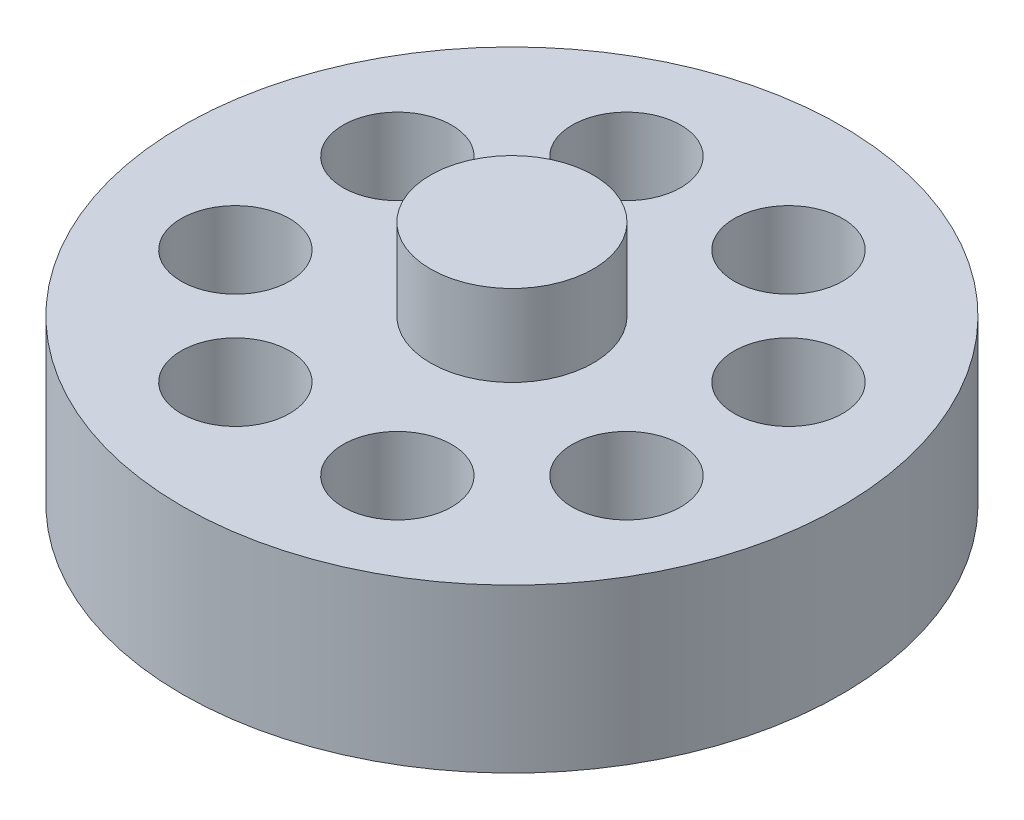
ISO-10303-21;
HEADER;
FILE_DESCRIPTION(('STEP AP214'),'2;1');
FILE_NAME('part.step','',(''),(''),'','','');
FILE_SCHEMA(('AUTOMOTIVE_DESIGN { 1 0 10303 214 1 1 1 1 }'));
ENDSEC;
DATA;
#1=APPLICATION_CONTEXT('core data for automotive mechanical design processes');
#2=APPLICATION_PROTOCOL_DEFINITION('international standard','automotive_design',2000,#1);
#3=PRODUCT_CONTEXT('',#1,'mechanical');
#4=PRODUCT('Part','Part','',(#3));
#5=PRODUCT_RELATED_PRODUCT_CATEGORY('part','',(#4));
#6=PRODUCT_DEFINITION_FORMATION('','',#4);
#7=PRODUCT_DEFINITION_CONTEXT('part definition',#1,'design');
#8=PRODUCT_DEFINITION('design','',#6,#7);
#9=PRODUCT_DEFINITION_SHAPE('','',#8);
#10=(LENGTH_UNIT() NAMED_UNIT(*) SI_UNIT(.MILLI.,.METRE.));
#11=(NAMED_UNIT(*) PLANE_ANGLE_UNIT() SI_UNIT($,.RADIAN.));
#12=(NAMED_UNIT(*) SI_UNIT($,.STERADIAN.) SOLID_ANGLE_UNIT());
#13=UNCERTAINTY_MEASURE_WITH_UNIT(LENGTH_MEASURE(1.E-05),#10,'distance_accuracy_value','');
#14=(GEOMETRIC_REPRESENTATION_CONTEXT(3) GLOBAL_UNCERTAINTY_ASSIGNED_CONTEXT((#13)) GLOBAL_UNIT_ASSIGNED_CONTEXT((#10,
#11,#12)) REPRESENTATION_CONTEXT('',''));
#15=CARTESIAN_POINT('',(0.,0.,0.));
#16=DIRECTION('',(0.,0.,1.));
#17=DIRECTION('',(1.,0.,0.));
#18=AXIS2_PLACEMENT_3D('',#15,#16,#17);
#19=CARTESIAN_POINT('',(0.,15.,0.));
#20=DIRECTION('',(0.,1.,0.));
#21=DIRECTION('',(0.,0.,1.));
#22=AXIS2_PLACEMENT_3D('',#19,#20,#21);
#23=PLANE('',#22);
#24=CARTESIAN_POINT('',(-36.0313017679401,15.,-14.9246538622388));
#25=DIRECTION('',(0.,1.,0.));
#26=DIRECTION('',(0.,0.,1.));
#27=AXIS2_PLACEMENT_3D('',#24,#25,#26);
#28=CIRCLE('',#27,10.);
#29=CARTESIAN_POINT('',(-36.0313017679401,15.,-4.92465386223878));
#30=VERTEX_POINT('',#29);
#31=EDGE_CURVE('E78',#30,#30,#28,.T.);
#32=ORIENTED_EDGE('',*,*,#31,.F.);
#33=EDGE_LOOP('',(#32));
#34=FACE_BOUND('',#33,.T.);
#35=CARTESIAN_POINT('',(-36.0313017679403,15.,14.9246538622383));
#36=DIRECTION('',(0.,1.,0.));
#37=DIRECTION('',(0.,0.,1.));
#38=AXIS2_PLACEMENT_3D('',#35,#36,#37);
#39=CIRCLE('',#38,10.);
#40=CARTESIAN_POINT('',(-36.0313017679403,15.,24.9246538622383));
#41=VERTEX_POINT('',#40);
#42=EDGE_CURVE('E80',#41,#41,#39,.T.);
#43=ORIENTED_EDGE('',*,*,#42,.F.);
#44=EDGE_LOOP('',(#43));
#45=FACE_BOUND('',#44,.T.);
#46=CARTESIAN_POINT('',(-14.9246538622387,15.,36.0313017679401));
#47=DIRECTION('',(0.,1.,0.));
#48=DIRECTION('',(0.,0.,1.));
#49=AXIS2_PLACEMENT_3D('',#46,#47,#48);
#50=CIRCLE('',#49,10.);
#51=CARTESIAN_POINT('',(-14.9246538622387,15.,46.0313017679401));
#52=VERTEX_POINT('',#51);
#53=EDGE_CURVE('E74',#52,#52,#50,.T.);
#54=ORIENTED_EDGE('',*,*,#53,.F.);
#55=EDGE_LOOP('',(#54));
#56=FACE_BOUND('',#55,.T.);
#57=CARTESIAN_POINT('',(14.9246538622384,15.,36.0313017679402));
#58=DIRECTION('',(0.,1.,0.));
#59=DIRECTION('',(0.,0.,1.));
#60=AXIS2_PLACEMENT_3D('',#57,#58,#59);
#61=CIRCLE('',#60,10.);
#62=CARTESIAN_POINT('',(14.9246538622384,15.,46.0313017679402));
#63=VERTEX_POINT('',#62);
#64=EDGE_CURVE('E68',#63,#63,#61,.T.);
#65=ORIENTED_EDGE('',*,*,#64,.F.);
#66=EDGE_LOOP('',(#65));
#67=FACE_BOUND('',#66,.T.);
#68=CARTESIAN_POINT('',(36.0313017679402,15.,14.9246538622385));
#69=DIRECTION('',(0.,1.,0.));
#70=DIRECTION('',(0.,0.,1.));
#71=AXIS2_PLACEMENT_3D('',#68,#69,#70);
#72=CIRCLE('',#71,10.);
#73=CARTESIAN_POINT('',(36.0313017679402,15.,24.9246538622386));
#74=VERTEX_POINT('',#73);
#75=EDGE_CURVE('E67',#74,#74,#72,.T.);
#76=ORIENTED_EDGE('',*,*,#75,.F.);
#77=EDGE_LOOP('',(#76));
#78=FACE_BOUND('',#77,.T.);
#79=CARTESIAN_POINT('',(36.0313017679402,15.,-14.9246538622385));
#80=DIRECTION('',(0.,1.,0.));
#81=DIRECTION('',(0.,0.,1.));
#82=AXIS2_PLACEMENT_3D('',#79,#80,#81);
#83=CIRCLE('',#82,10.);
#84=CARTESIAN_POINT('',(36.0313017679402,15.,-4.92465386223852));
#85=VERTEX_POINT('',#84);
#86=EDGE_CURVE('E65',#85,#85,#83,.T.);
#87=ORIENTED_EDGE('',*,*,#86,.F.);
#88=EDGE_LOOP('',(#87));
#89=FACE_BOUND('',#88,.T.);
#90=CARTESIAN_POINT('',(14.9246538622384,15.,-36.0313017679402));
#91=DIRECTION('',(0.,1.,0.));
#92=DIRECTION('',(0.,0.,1.));
#93=AXIS2_PLACEMENT_3D('',#90,#91,#92);
#94=CIRCLE('',#93,10.);
#95=CARTESIAN_POINT('',(14.9246538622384,15.,-26.0313017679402));
#96=VERTEX_POINT('',#95);
#97=EDGE_CURVE('E62',#96,#96,#94,.T.);
#98=ORIENTED_EDGE('',*,*,#97,.F.);
#99=EDGE_LOOP('',(#98));
#100=FACE_BOUND('',#99,.T.);
#101=CARTESIAN_POINT('',(0.,15.,0.));
#102=DIRECTION('',(0.,1.,0.));
#103=DIRECTION('',(0.,0.,1.));
#104=AXIS2_PLACEMENT_3D('',#101,#102,#103);
#105=CIRCLE('',#104,60.725);
#106=CARTESIAN_POINT('',(0.,15.,60.725));
#107=VERTEX_POINT('',#106);
#108=EDGE_CURVE('E47',#107,#107,#105,.T.);
#109=ORIENTED_EDGE('',*,*,#108,.T.);
#110=EDGE_LOOP('',(#109));
#111=FACE_BOUND('',#110,.T.);
#112=CARTESIAN_POINT('',(-14.9246538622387,15.,-36.0313017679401));
#113=DIRECTION('',(0.,1.,0.));
#114=DIRECTION('',(0.,0.,1.));
#115=AXIS2_PLACEMENT_3D('',#112,#113,#114);
#116=CIRCLE('',#115,10.);
#117=CARTESIAN_POINT('',(-14.9246538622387,15.,-26.0313017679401));
#118=VERTEX_POINT('',#117);
#119=EDGE_CURVE('E109',#118,#118,#116,.T.);
#120=ORIENTED_EDGE('',*,*,#119,.F.);
#121=EDGE_LOOP('',(#120));
#122=FACE_BOUND('',#121,.T.);
#123=CARTESIAN_POINT('',(0.,15.,0.));
#124=DIRECTION('',(0.,1.,0.));
#125=DIRECTION('',(0.,0.,1.));
#126=AXIS2_PLACEMENT_3D('',#123,#124,#125);
#127=CIRCLE('',#126,15.);
#128=CARTESIAN_POINT('',(0.,15.,15.));
#129=VERTEX_POINT('',#128);
#130=EDGE_CURVE('E110',#129,#129,#127,.F.);
#131=ORIENTED_EDGE('',*,*,#130,.T.);
#132=EDGE_LOOP('',(#131));
#133=FACE_BOUND('',#132,.T.);
#134=ADVANCED_FACE('F41',(#34,#45,#56,#67,#78,#89,#100,#111,#122,#133),#23,.T.);
#135=CARTESIAN_POINT('',(0.,-15.,0.));
#136=DIRECTION('',(0.,1.,0.));
#137=DIRECTION('',(0.,0.,1.));
#138=AXIS2_PLACEMENT_3D('',#135,#136,#137);
#139=PLANE('',#138);
#140=CARTESIAN_POINT('',(-36.0313017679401,-15.,-14.9246538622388));
#141=DIRECTION('',(0.,1.,0.));
#142=DIRECTION('',(0.,0.,1.));
#143=AXIS2_PLACEMENT_3D('',#140,#141,#142);
#144=CIRCLE('',#143,10.);
#145=CARTESIAN_POINT('',(-36.0313017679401,-15.,-4.92465386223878));
#146=VERTEX_POINT('',#145);
#147=EDGE_CURVE('E44',#146,#146,#144,.T.);
#148=ORIENTED_EDGE('',*,*,#147,.T.);
#149=EDGE_LOOP('',(#148));
#150=FACE_BOUND('',#149,.T.);
#151=CARTESIAN_POINT('',(-36.0313017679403,-15.,14.9246538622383));
#152=DIRECTION('',(0.,1.,0.));
#153=DIRECTION('',(0.,0.,1.));
#154=AXIS2_PLACEMENT_3D('',#151,#152,#153);
#155=CIRCLE('',#154,10.);
#156=CARTESIAN_POINT('',(-36.0313017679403,-15.,24.9246538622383));
#157=VERTEX_POINT('',#156);
#158=EDGE_CURVE('E76',#157,#157,#155,.T.);
#159=ORIENTED_EDGE('',*,*,#158,.T.);
#160=EDGE_LOOP('',(#159));
#161=FACE_BOUND('',#160,.T.);
#162=CARTESIAN_POINT('',(-14.9246538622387,-15.,36.0313017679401));
#163=DIRECTION('',(0.,1.,0.));
#164=DIRECTION('',(0.,0.,1.));
#165=AXIS2_PLACEMENT_3D('',#162,#163,#164);
#166=CIRCLE('',#165,10.);
#167=CARTESIAN_POINT('',(-14.9246538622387,-15.,46.0313017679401));
#168=VERTEX_POINT('',#167);
#169=EDGE_CURVE('E72',#168,#168,#166,.T.);
#170=ORIENTED_EDGE('',*,*,#169,.T.);
#171=EDGE_LOOP('',(#170));
#172=FACE_BOUND('',#171,.T.);
#173=CARTESIAN_POINT('',(14.9246538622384,-15.,36.0313017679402));
#174=DIRECTION('',(0.,1.,0.));
#175=DIRECTION('',(0.,0.,1.));
#176=AXIS2_PLACEMENT_3D('',#173,#174,#175);
#177=CIRCLE('',#176,10.);
#178=CARTESIAN_POINT('',(14.9246538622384,-15.,46.0313017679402));
#179=VERTEX_POINT('',#178);
#180=EDGE_CURVE('E73',#179,#179,#177,.T.);
#181=ORIENTED_EDGE('',*,*,#180,.T.);
#182=EDGE_LOOP('',(#181));
#183=FACE_BOUND('',#182,.T.);
#184=CARTESIAN_POINT('',(36.0313017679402,-15.,14.9246538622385));
#185=DIRECTION('',(0.,1.,0.));
#186=DIRECTION('',(0.,0.,1.));
#187=AXIS2_PLACEMENT_3D('',#184,#185,#186);
#188=CIRCLE('',#187,10.);
#189=CARTESIAN_POINT('',(36.0313017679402,-15.,24.9246538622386));
#190=VERTEX_POINT('',#189);
#191=EDGE_CURVE('E69',#190,#190,#188,.T.);
#192=ORIENTED_EDGE('',*,*,#191,.T.);
#193=EDGE_LOOP('',(#192));
#194=FACE_BOUND('',#193,.T.);
#195=CARTESIAN_POINT('',(36.0313017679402,-15.,-14.9246538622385));
#196=DIRECTION('',(0.,1.,0.));
#197=DIRECTION('',(0.,0.,1.));
#198=AXIS2_PLACEMENT_3D('',#195,#196,#197);
#199=CIRCLE('',#198,10.);
#200=CARTESIAN_POINT('',(36.0313017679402,-15.,-4.92465386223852));
#201=VERTEX_POINT('',#200);
#202=EDGE_CURVE('E64',#201,#201,#199,.T.);
#203=ORIENTED_EDGE('',*,*,#202,.T.);
#204=EDGE_LOOP('',(#203));
#205=FACE_BOUND('',#204,.T.);
#206=CARTESIAN_POINT('',(14.9246538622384,-15.,-36.0313017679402));
#207=DIRECTION('',(0.,1.,0.));
#208=DIRECTION('',(0.,0.,1.));
#209=AXIS2_PLACEMENT_3D('',#206,#207,#208);
#210=CIRCLE('',#209,10.);
#211=CARTESIAN_POINT('',(14.9246538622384,-15.,-26.0313017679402));
#212=VERTEX_POINT('',#211);
#213=EDGE_CURVE('E59',#212,#212,#210,.T.);
#214=ORIENTED_EDGE('',*,*,#213,.T.);
#215=EDGE_LOOP('',(#214));
#216=FACE_BOUND('',#215,.T.);
#217=CARTESIAN_POINT('',(0.,-15.,0.));
#218=DIRECTION('',(0.,1.,0.));
#219=DIRECTION('',(0.,0.,1.));
#220=AXIS2_PLACEMENT_3D('',#217,#218,#219);
#221=CIRCLE('',#220,60.725);
#222=CARTESIAN_POINT('',(0.,-15.,60.725));
#223=VERTEX_POINT('',#222);
#224=EDGE_CURVE('E53',#223,#223,#221,.T.);
#225=ORIENTED_EDGE('',*,*,#224,.F.);
#226=EDGE_LOOP('',(#225));
#227=FACE_BOUND('',#226,.T.);
#228=CARTESIAN_POINT('',(-14.9246538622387,-15.,-36.0313017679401));
#229=DIRECTION('',(0.,1.,0.));
#230=DIRECTION('',(0.,0.,1.));
#231=AXIS2_PLACEMENT_3D('',#228,#229,#230);
#232=CIRCLE('',#231,10.);
#233=CARTESIAN_POINT('',(-14.9246538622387,-15.,-26.0313017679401));
#234=VERTEX_POINT('',#233);
#235=EDGE_CURVE('E113',#234,#234,#232,.T.);
#236=ORIENTED_EDGE('',*,*,#235,.T.);
#237=EDGE_LOOP('',(#236));
#238=FACE_BOUND('',#237,.T.);
#239=CARTESIAN_POINT('',(0.,-15.,0.));
#240=DIRECTION('',(0.,1.,0.));
#241=DIRECTION('',(0.,0.,1.));
#242=AXIS2_PLACEMENT_3D('',#239,#240,#241);
#243=CIRCLE('',#242,15.);
#244=CARTESIAN_POINT('',(0.,-15.,15.));
#245=VERTEX_POINT('',#244);
#246=EDGE_CURVE('E10',#245,#245,#243,.F.);
#247=ORIENTED_EDGE('',*,*,#246,.F.);
#248=EDGE_LOOP('',(#247));
#249=FACE_BOUND('',#248,.T.);
#250=ADVANCED_FACE('F122',(#150,#161,#172,#183,#194,#205,#216,#227,#238,#249),#139,.F.);
#251=CARTESIAN_POINT('',(0.,15.,0.));
#252=DIRECTION('',(0.,-1.,0.));
#253=DIRECTION('',(0.,0.,-1.));
#254=AXIS2_PLACEMENT_3D('',#251,#252,#253);
#255=CYLINDRICAL_SURFACE('',#254,60.725);
#256=ORIENTED_EDGE('',*,*,#108,.F.);
#257=EDGE_LOOP('',(#256));
#258=FACE_BOUND('',#257,.T.);
#259=ORIENTED_EDGE('',*,*,#224,.T.);
#260=EDGE_LOOP('',(#259));
#261=FACE_BOUND('',#260,.T.);
#262=ADVANCED_FACE('F43',(#258,#261),#255,.T.);
#263=CARTESIAN_POINT('',(-14.9246538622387,-15.,-36.0313017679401));
#264=DIRECTION('',(0.,1.,0.));
#265=DIRECTION('',(0.,0.,1.));
#266=AXIS2_PLACEMENT_3D('',#263,#264,#265);
#267=CYLINDRICAL_SURFACE('',#266,10.);
#268=ORIENTED_EDGE('',*,*,#235,.F.);
#269=EDGE_LOOP('',(#268));
#270=FACE_BOUND('',#269,.T.);
#271=ORIENTED_EDGE('',*,*,#119,.T.);
#272=EDGE_LOOP('',(#271));
#273=FACE_BOUND('',#272,.T.);
#274=ADVANCED_FACE('F128',(#270,#273),#267,.F.);
#275=CARTESIAN_POINT('',(0.,-30.,0.));
#276=DIRECTION('',(0.,1.,0.));
#277=DIRECTION('',(0.,0.,1.));
#278=AXIS2_PLACEMENT_3D('',#275,#276,#277);
#279=PLANE('',#278);
#280=CARTESIAN_POINT('',(0.,-30.,0.));
#281=DIRECTION('',(0.,1.,0.));
#282=DIRECTION('',(0.,0.,1.));
#283=AXIS2_PLACEMENT_3D('',#280,#281,#282);
#284=CIRCLE('',#283,15.);
#285=CARTESIAN_POINT('',(0.,-30.,15.));
#286=VERTEX_POINT('',#285);
#287=EDGE_CURVE('E103',#286,#286,#284,.T.);
#288=ORIENTED_EDGE('',*,*,#287,.F.);
#289=EDGE_LOOP('',(#288));
#290=FACE_BOUND('',#289,.T.);
#291=ADVANCED_FACE('F140',(#290),#279,.F.);
#292=CARTESIAN_POINT('',(0.,30.,0.));
#293=DIRECTION('',(0.,-1.,0.));
#294=DIRECTION('',(0.,0.,-1.));
#295=AXIS2_PLACEMENT_3D('',#292,#293,#294);
#296=CYLINDRICAL_SURFACE('',#295,15.);
#297=ORIENTED_EDGE('',*,*,#287,.T.);
#298=EDGE_LOOP('',(#297));
#299=FACE_BOUND('',#298,.T.);
#300=ORIENTED_EDGE('',*,*,#246,.T.);
#301=EDGE_LOOP('',(#300));
#302=FACE_BOUND('',#301,.T.);
#303=ADVANCED_FACE('F141',(#299,#302),#296,.T.);
#304=ORIENTED_EDGE('',*,*,#130,.F.);
#305=EDGE_LOOP('',(#304));
#306=FACE_BOUND('',#305,.T.);
#307=CARTESIAN_POINT('',(0.,30.,0.));
#308=DIRECTION('',(0.,1.,0.));
#309=DIRECTION('',(0.,0.,1.));
#310=AXIS2_PLACEMENT_3D('',#307,#308,#309);
#311=CIRCLE('',#310,15.);
#312=CARTESIAN_POINT('',(0.,30.,15.));
#313=VERTEX_POINT('',#312);
#314=EDGE_CURVE('E104',#313,#313,#311,.T.);
#315=ORIENTED_EDGE('',*,*,#314,.F.);
#316=EDGE_LOOP('',(#315));
#317=FACE_BOUND('',#316,.T.);
#318=ADVANCED_FACE('F139',(#306,#317),#296,.T.);
#319=CARTESIAN_POINT('',(0.,30.,0.));
#320=DIRECTION('',(0.,1.,0.));
#321=DIRECTION('',(0.,0.,1.));
#322=AXIS2_PLACEMENT_3D('',#319,#320,#321);
#323=PLANE('',#322);
#324=ORIENTED_EDGE('',*,*,#314,.T.);
#325=EDGE_LOOP('',(#324));
#326=FACE_BOUND('',#325,.T.);
#327=ADVANCED_FACE('F145',(#326),#323,.T.);
#328=CARTESIAN_POINT('',(14.9246538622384,-30.,-36.0313017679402));
#329=DIRECTION('',(0.,1.,0.));
#330=DIRECTION('',(0.,0.,1.));
#331=AXIS2_PLACEMENT_3D('',#328,#329,#330);
#332=CYLINDRICAL_SURFACE('',#331,10.);
#333=ORIENTED_EDGE('',*,*,#97,.T.);
#334=EDGE_LOOP('',(#333));
#335=FACE_BOUND('',#334,.T.);
#336=ORIENTED_EDGE('',*,*,#213,.F.);
#337=EDGE_LOOP('',(#336));
#338=FACE_BOUND('',#337,.T.);
#339=ADVANCED_FACE('F150',(#335,#338),#332,.F.);
#340=CARTESIAN_POINT('',(36.0313017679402,-30.,-14.9246538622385));
#341=DIRECTION('',(0.,1.,0.));
#342=DIRECTION('',(0.,0.,1.));
#343=AXIS2_PLACEMENT_3D('',#340,#341,#342);
#344=CYLINDRICAL_SURFACE('',#343,10.);
#345=ORIENTED_EDGE('',*,*,#86,.T.);
#346=EDGE_LOOP('',(#345));
#347=FACE_BOUND('',#346,.T.);
#348=ORIENTED_EDGE('',*,*,#202,.F.);
#349=EDGE_LOOP('',(#348));
#350=FACE_BOUND('',#349,.T.);
#351=ADVANCED_FACE('F152',(#347,#350),#344,.F.);
#352=CARTESIAN_POINT('',(36.0313017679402,-30.,14.9246538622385));
#353=DIRECTION('',(0.,1.,0.));
#354=DIRECTION('',(0.,0.,1.));
#355=AXIS2_PLACEMENT_3D('',#352,#353,#354);
#356=CYLINDRICAL_SURFACE('',#355,10.);
#357=ORIENTED_EDGE('',*,*,#75,.T.);
#358=EDGE_LOOP('',(#357));
#359=FACE_BOUND('',#358,.T.);
#360=ORIENTED_EDGE('',*,*,#191,.F.);
#361=EDGE_LOOP('',(#360));
#362=FACE_BOUND('',#361,.T.);
#363=ADVANCED_FACE('F159',(#359,#362),#356,.F.);
#364=CARTESIAN_POINT('',(14.9246538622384,-30.,36.0313017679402));
#365=DIRECTION('',(0.,1.,0.));
#366=DIRECTION('',(0.,0.,1.));
#367=AXIS2_PLACEMENT_3D('',#364,#365,#366);
#368=CYLINDRICAL_SURFACE('',#367,10.);
#369=ORIENTED_EDGE('',*,*,#64,.T.);
#370=EDGE_LOOP('',(#369));
#371=FACE_BOUND('',#370,.T.);
#372=ORIENTED_EDGE('',*,*,#180,.F.);
#373=EDGE_LOOP('',(#372));
#374=FACE_BOUND('',#373,.T.);
#375=ADVANCED_FACE('F163',(#371,#374),#368,.F.);
#376=CARTESIAN_POINT('',(-14.9246538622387,-30.,36.0313017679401));
#377=DIRECTION('',(0.,1.,0.));
#378=DIRECTION('',(0.,0.,1.));
#379=AXIS2_PLACEMENT_3D('',#376,#377,#378);
#380=CYLINDRICAL_SURFACE('',#379,10.);
#381=ORIENTED_EDGE('',*,*,#53,.T.);
#382=EDGE_LOOP('',(#381));
#383=FACE_BOUND('',#382,.T.);
#384=ORIENTED_EDGE('',*,*,#169,.F.);
#385=EDGE_LOOP('',(#384));
#386=FACE_BOUND('',#385,.T.);
#387=ADVANCED_FACE('F164',(#383,#386),#380,.F.);
#388=CARTESIAN_POINT('',(-36.0313017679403,-30.,14.9246538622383));
#389=DIRECTION('',(0.,1.,0.));
#390=DIRECTION('',(0.,0.,1.));
#391=AXIS2_PLACEMENT_3D('',#388,#389,#390);
#392=CYLINDRICAL_SURFACE('',#391,10.);
#393=ORIENTED_EDGE('',*,*,#42,.T.);
#394=EDGE_LOOP('',(#393));
#395=FACE_BOUND('',#394,.T.);
#396=ORIENTED_EDGE('',*,*,#158,.F.);
#397=EDGE_LOOP('',(#396));
#398=FACE_BOUND('',#397,.T.);
#399=ADVANCED_FACE('F169',(#395,#398),#392,.F.);
#400=CARTESIAN_POINT('',(-36.0313017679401,-30.,-14.9246538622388));
#401=DIRECTION('',(0.,1.,0.));
#402=DIRECTION('',(0.,0.,1.));
#403=AXIS2_PLACEMENT_3D('',#400,#401,#402);
#404=CYLINDRICAL_SURFACE('',#403,10.);
#405=ORIENTED_EDGE('',*,*,#31,.T.);
#406=EDGE_LOOP('',(#405));
#407=FACE_BOUND('',#406,.T.);
#408=ORIENTED_EDGE('',*,*,#147,.F.);
#409=EDGE_LOOP('',(#408));
#410=FACE_BOUND('',#409,.T.);
#411=ADVANCED_FACE('F173',(#407,#410),#404,.F.);
#412=CLOSED_SHELL('',(#134,#250,#262,#274,#291,#303,#318,#327,#339,#351,#363,#375,#387,#399,#411));
#413=MANIFOLD_SOLID_BREP('B2',#412);
#414=ADVANCED_BREP_SHAPE_REPRESENTATION('',(#18,#413),#14);
#415=SHAPE_DEFINITION_REPRESENTATION(#9,#414);
ENDSEC;
END-ISO-10303-21;
